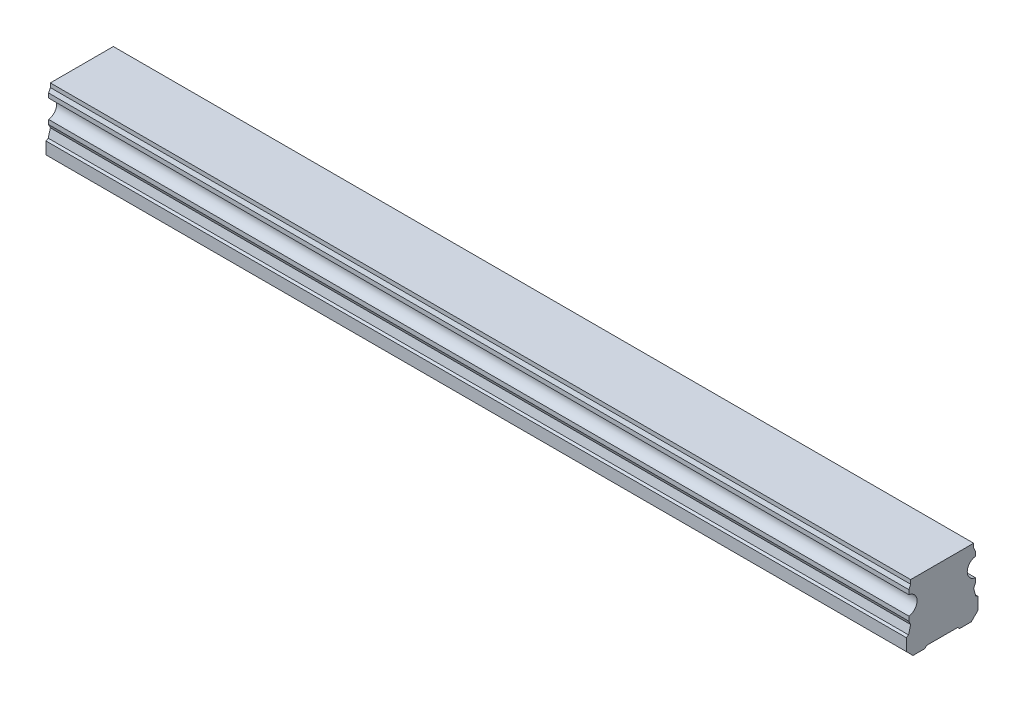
from build123d import *

# Parameters (mm, degrees)
BOSS_EXTRUDE1_DEPTH        = 180
SKETCH3_R                  = 2.5
SKETCH3_R_2                = 2.1
CUT_EXTRUDE3_DEPTH         = 7
SKETCH3_2_R                = 2.1
CUT_EXTRUDE4_DEPTH         = 9.5
CHAMFER1_SIZE              = 0.4
LPATTERN2_COUNT            = 3
LPATTERN2_PITCH            = 60
CHAMFER1_OF_LPATTERN2_SIZE = 0.4


with BuildPart() as part:
    # Sketch1 → Boss-Extrude1 (new body)
    with BuildSketch(Plane(origin=(0, 0, 0), x_dir=(0, 0, -1), z_dir=(1, 0, 0))):
        with BuildLine():
            Line((6.59, 14), (-6.59, 14))
            Line((-6.59, 14), (-6.59, 13.15))
            Line((-6.59, 13.15), (-6.96, 12.356532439))
            Line((-6.96, 12.356532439), (-6.96, 11.435174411))
            ThreePointArc((-6.96, 11.435174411), (-5.25, 9.5), (-6.96, 7.564825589))
            Line((-6.96, 7.564825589), (-6.96, 6.643467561))
            Line((-6.96, 6.643467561), (-6.59, 5.85))
            Line((-6.59, 5.85), (-7.032116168, 4.2))
            Line((-7.032116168, 4.2), (-7.5, 3.929867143))
            Line((-7.5, 3.929867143), (-7.5, 1.4))
            Line((-7.5, 1.4), (-6.1, 0))
            Line((-6.1, 0), (-3.65, 0))
            Line((-3.65, 0), (-3.25, 0.4))
            Line((-3.25, 0.4), (3.25, 0.4))
            Line((3.25, 0.4), (3.65, 0))
            Line((3.65, 0), (6.1, 0))
            Line((6.1, 0), (7.5, 1.4))
            Line((7.5, 1.4), (7.5, 3.929867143))
            Line((7.5, 3.929867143), (7.032116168, 4.2))
            Line((7.032116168, 4.2), (6.59, 5.85))
            Line((6.59, 5.85), (6.96, 6.643467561))
            Line((6.96, 6.643467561), (6.96, 7.564825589))
            ThreePointArc((6.96, 7.564825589), (5.25, 9.5), (6.96, 11.435174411))
            Line((6.96, 11.435174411), (6.96, 12.356532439))
            Line((6.96, 12.356532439), (6.59, 13.15))
            Line((6.59, 13.15), (6.59, 14))
        make_face()
    extrude(amount=BOSS_EXTRUDE1_DEPTH)

    # Sketch3 → Cut-Extrude3 (cut)
    with BuildSketch(Plane.XZ):
        with Locations(Location((30, 0, 0), (0, 0, 270))):
            Circle(SKETCH3_R)
        with Locations(Location((30, 0, 0), (0, 0, 270))):
            Circle(SKETCH3_R_2, mode=Mode.SUBTRACT)
    cut_extrude3 = extrude(amount=-CUT_EXTRUDE3_DEPTH, mode=Mode.SUBTRACT)

    # Sketch3_2 → Cut-Extrude4 (cut)
    with BuildSketch(Plane.XZ):
        with Locations(Location((30, 0, 0), (0, 0, 270))):
            Circle(SKETCH3_2_R)
    cut_extrude4 = extrude(amount=-CUT_EXTRUDE4_DEPTH, mode=Mode.SUBTRACT)

    # Cut-Extrude5 cone 1 section (on through the dimple's axis) → Cut-Extrude5 (revolve, cut)
    with BuildSketch(Plane(origin=(30, 9.5, 0), x_dir=(0, 0, -1), z_dir=(1, 0, 0))):
        Polygon((0, 0), (2.1, 0), (0, 1.212435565), align=None)
    revolve(axis=Axis((30, 9.5, 0), (0, 1, 0)), mode=Mode.SUBTRACT)

    # Chamfer1
    chamfer1_edges = [part.edges().sort_by_distance(p)[0] for p in [
        (30, 0.4, 2.5),
    ]]
    chamfer(chamfer1_edges, length=CHAMFER1_SIZE)

    # LPattern2: Cut-Extrude3, Cut-Extrude4 ×3
    with Locations(*[(i * LPATTERN2_PITCH, 0, 0) for i in range(1, LPATTERN2_COUNT)]):
        add(cut_extrude3, mode=Mode.SUBTRACT)
        add(cut_extrude4, mode=Mode.SUBTRACT)

    # Chamfer1 of LPattern2
    chamfer1_of_lpattern2_edges = [part.edges().sort_by_distance(p)[0] for p in [
        (90, 0.4, 2.5),
        (150, 0.4, 2.5),
    ]]
    chamfer(chamfer1_of_lpattern2_edges, length=CHAMFER1_OF_LPATTERN2_SIZE)


solid = part.part
